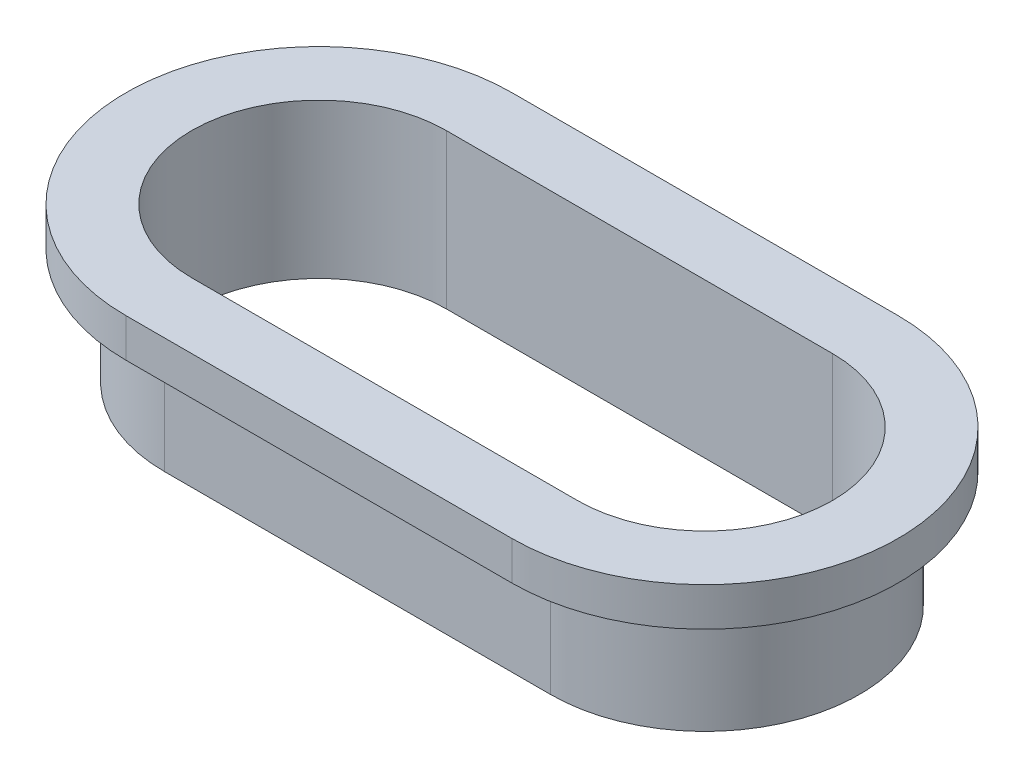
ISO-10303-21;
HEADER;
FILE_DESCRIPTION(('STEP AP214'),'2;1');
FILE_NAME('part.step','',(''),(''),'','','');
FILE_SCHEMA(('AUTOMOTIVE_DESIGN { 1 0 10303 214 1 1 1 1 }'));
ENDSEC;
DATA;
#1=APPLICATION_CONTEXT('core data for automotive mechanical design processes');
#2=APPLICATION_PROTOCOL_DEFINITION('international standard','automotive_design',2000,#1);
#3=PRODUCT_CONTEXT('',#1,'mechanical');
#4=PRODUCT('Part','Part','',(#3));
#5=PRODUCT_RELATED_PRODUCT_CATEGORY('part','',(#4));
#6=PRODUCT_DEFINITION_FORMATION('','',#4);
#7=PRODUCT_DEFINITION_CONTEXT('part definition',#1,'design');
#8=PRODUCT_DEFINITION('design','',#6,#7);
#9=PRODUCT_DEFINITION_SHAPE('','',#8);
#10=(LENGTH_UNIT() NAMED_UNIT(*) SI_UNIT(.MILLI.,.METRE.));
#11=(NAMED_UNIT(*) PLANE_ANGLE_UNIT() SI_UNIT($,.RADIAN.));
#12=(NAMED_UNIT(*) SI_UNIT($,.STERADIAN.) SOLID_ANGLE_UNIT());
#13=UNCERTAINTY_MEASURE_WITH_UNIT(LENGTH_MEASURE(1.E-05),#10,'distance_accuracy_value','');
#14=(GEOMETRIC_REPRESENTATION_CONTEXT(3) GLOBAL_UNCERTAINTY_ASSIGNED_CONTEXT((#13)) GLOBAL_UNIT_ASSIGNED_CONTEXT((#10,
#11,#12)) REPRESENTATION_CONTEXT('',''));
#15=CARTESIAN_POINT('',(0.,0.,0.));
#16=DIRECTION('',(0.,0.,1.));
#17=DIRECTION('',(1.,0.,0.));
#18=AXIS2_PLACEMENT_3D('',#15,#16,#17);
#19=CARTESIAN_POINT('',(2.5,2.,0.));
#20=DIRECTION('',(0.,-1.,0.));
#21=DIRECTION('',(0.,0.,-1.));
#22=AXIS2_PLACEMENT_3D('',#19,#20,#21);
#23=CYLINDRICAL_SURFACE('',#22,2.);
#24=DIRECTION('',(0.,1.,0.));
#25=VECTOR('',#24,1.);
#26=CARTESIAN_POINT('',(2.5,2.,2.));
#27=LINE('',#26,#25);
#28=CARTESIAN_POINT('',(2.5,1.5,2.));
#29=VERTEX_POINT('',#28);
#30=CARTESIAN_POINT('',(2.5,0.,2.));
#31=VERTEX_POINT('',#30);
#32=EDGE_CURVE('E104',#29,#31,#27,.F.);
#33=ORIENTED_EDGE('',*,*,#32,.T.);
#34=CARTESIAN_POINT('',(2.5,0.,0.));
#35=DIRECTION('',(0.,-1.,0.));
#36=DIRECTION('',(0.,0.,-1.));
#37=AXIS2_PLACEMENT_3D('',#34,#35,#36);
#38=CIRCLE('',#37,2.);
#39=CARTESIAN_POINT('',(2.5,0.,-2.));
#40=VERTEX_POINT('',#39);
#41=EDGE_CURVE('E20',#31,#40,#38,.F.);
#42=ORIENTED_EDGE('',*,*,#41,.T.);
#43=DIRECTION('',(0.,1.,0.));
#44=VECTOR('',#43,1.);
#45=CARTESIAN_POINT('',(2.5,2.,-2.));
#46=LINE('',#45,#44);
#47=CARTESIAN_POINT('',(2.5,1.5,-2.));
#48=VERTEX_POINT('',#47);
#49=EDGE_CURVE('E108',#40,#48,#46,.T.);
#50=ORIENTED_EDGE('',*,*,#49,.T.);
#51=CARTESIAN_POINT('',(2.5,1.5,0.));
#52=DIRECTION('',(0.,-1.,0.));
#53=DIRECTION('',(0.,0.,-1.));
#54=AXIS2_PLACEMENT_3D('',#51,#52,#53);
#55=CIRCLE('',#54,2.);
#56=EDGE_CURVE('E171',#48,#29,#55,.T.);
#57=ORIENTED_EDGE('',*,*,#56,.T.);
#58=EDGE_LOOP('',(#33,#42,#50,#57));
#59=FACE_BOUND('',#58,.T.);
#60=ADVANCED_FACE('F17',(#59),#23,.T.);
#61=CARTESIAN_POINT('',(-4.5,2.,2.));
#62=DIRECTION('',(0.,0.,-1.));
#63=DIRECTION('',(-1.,0.,0.));
#64=AXIS2_PLACEMENT_3D('',#61,#62,#63);
#65=PLANE('',#64);
#66=ORIENTED_EDGE('',*,*,#32,.F.);
#67=DIRECTION('',(1.,0.,0.));
#68=VECTOR('',#67,1.);
#69=CARTESIAN_POINT('',(0.,1.5,2.));
#70=LINE('',#69,#68);
#71=CARTESIAN_POINT('',(-2.5,1.5,2.));
#72=VERTEX_POINT('',#71);
#73=EDGE_CURVE('E170',#29,#72,#70,.F.);
#74=ORIENTED_EDGE('',*,*,#73,.T.);
#75=DIRECTION('',(0.,-1.,0.));
#76=VECTOR('',#75,1.);
#77=CARTESIAN_POINT('',(-2.5,2.,2.));
#78=LINE('',#77,#76);
#79=CARTESIAN_POINT('',(-2.5,0.,2.));
#80=VERTEX_POINT('',#79);
#81=EDGE_CURVE('E123',#80,#72,#78,.F.);
#82=ORIENTED_EDGE('',*,*,#81,.F.);
#83=DIRECTION('',(1.,0.,0.));
#84=VECTOR('',#83,1.);
#85=CARTESIAN_POINT('',(0.,0.,2.));
#86=LINE('',#85,#84);
#87=EDGE_CURVE('E129',#80,#31,#86,.T.);
#88=ORIENTED_EDGE('',*,*,#87,.T.);
#89=EDGE_LOOP('',(#66,#74,#82,#88));
#90=FACE_BOUND('',#89,.T.);
#91=ADVANCED_FACE('F174',(#90),#65,.F.);
#92=CARTESIAN_POINT('',(-2.5,2.,0.));
#93=DIRECTION('',(0.,-1.,0.));
#94=DIRECTION('',(0.,0.,-1.));
#95=AXIS2_PLACEMENT_3D('',#92,#93,#94);
#96=CYLINDRICAL_SURFACE('',#95,2.);
#97=DIRECTION('',(0.,1.,0.));
#98=VECTOR('',#97,1.);
#99=CARTESIAN_POINT('',(-2.5,2.,-2.));
#100=LINE('',#99,#98);
#101=CARTESIAN_POINT('',(-2.5,1.5,-2.));
#102=VERTEX_POINT('',#101);
#103=CARTESIAN_POINT('',(-2.5,0.,-2.));
#104=VERTEX_POINT('',#103);
#105=EDGE_CURVE('E114',#102,#104,#100,.F.);
#106=ORIENTED_EDGE('',*,*,#105,.T.);
#107=CARTESIAN_POINT('',(-2.5,0.,0.));
#108=DIRECTION('',(0.,-1.,0.));
#109=DIRECTION('',(0.,0.,-1.));
#110=AXIS2_PLACEMENT_3D('',#107,#108,#109);
#111=CIRCLE('',#110,2.);
#112=EDGE_CURVE('E127',#104,#80,#111,.F.);
#113=ORIENTED_EDGE('',*,*,#112,.T.);
#114=ORIENTED_EDGE('',*,*,#81,.T.);
#115=CARTESIAN_POINT('',(-2.5,1.5,0.));
#116=DIRECTION('',(0.,-1.,0.));
#117=DIRECTION('',(0.,0.,-1.));
#118=AXIS2_PLACEMENT_3D('',#115,#116,#117);
#119=CIRCLE('',#118,2.);
#120=EDGE_CURVE('E168',#72,#102,#119,.T.);
#121=ORIENTED_EDGE('',*,*,#120,.T.);
#122=EDGE_LOOP('',(#106,#113,#114,#121));
#123=FACE_BOUND('',#122,.T.);
#124=ADVANCED_FACE('F178',(#123),#96,.T.);
#125=CARTESIAN_POINT('',(-4.5,2.,-2.));
#126=DIRECTION('',(0.,0.,1.));
#127=DIRECTION('',(1.,0.,0.));
#128=AXIS2_PLACEMENT_3D('',#125,#126,#127);
#129=PLANE('',#128);
#130=ORIENTED_EDGE('',*,*,#105,.F.);
#131=DIRECTION('',(1.,0.,0.));
#132=VECTOR('',#131,1.);
#133=CARTESIAN_POINT('',(0.,1.5,-2.));
#134=LINE('',#133,#132);
#135=EDGE_CURVE('E121',#102,#48,#134,.T.);
#136=ORIENTED_EDGE('',*,*,#135,.T.);
#137=ORIENTED_EDGE('',*,*,#49,.F.);
#138=DIRECTION('',(1.,0.,0.));
#139=VECTOR('',#138,1.);
#140=CARTESIAN_POINT('',(0.,0.,-2.));
#141=LINE('',#140,#139);
#142=EDGE_CURVE('E113',#40,#104,#141,.F.);
#143=ORIENTED_EDGE('',*,*,#142,.T.);
#144=EDGE_LOOP('',(#130,#136,#137,#143));
#145=FACE_BOUND('',#144,.T.);
#146=ADVANCED_FACE('F118',(#145),#129,.F.);
#147=CARTESIAN_POINT('',(0.,0.,0.));
#148=DIRECTION('',(0.,1.,0.));
#149=DIRECTION('',(0.,0.,1.));
#150=AXIS2_PLACEMENT_3D('',#147,#148,#149);
#151=PLANE('',#150);
#152=CARTESIAN_POINT('',(2.5,0.,0.));
#153=DIRECTION('',(0.,1.,0.));
#154=DIRECTION('',(0.,0.,1.));
#155=AXIS2_PLACEMENT_3D('',#152,#153,#154);
#156=CIRCLE('',#155,1.65);
#157=CARTESIAN_POINT('',(2.5,0.,1.65));
#158=VERTEX_POINT('',#157);
#159=CARTESIAN_POINT('',(2.5,0.,-1.65));
#160=VERTEX_POINT('',#159);
#161=EDGE_CURVE('E164',#158,#160,#156,.T.);
#162=ORIENTED_EDGE('',*,*,#161,.T.);
#163=DIRECTION('',(1.,0.,0.));
#164=VECTOR('',#163,1.);
#165=CARTESIAN_POINT('',(-4.15,0.,-1.65));
#166=LINE('',#165,#164);
#167=CARTESIAN_POINT('',(-2.5,0.,-1.65));
#168=VERTEX_POINT('',#167);
#169=EDGE_CURVE('E133',#168,#160,#166,.T.);
#170=ORIENTED_EDGE('',*,*,#169,.F.);
#171=CARTESIAN_POINT('',(-2.5,0.,0.));
#172=DIRECTION('',(0.,1.,0.));
#173=DIRECTION('',(0.,0.,1.));
#174=AXIS2_PLACEMENT_3D('',#171,#172,#173);
#175=CIRCLE('',#174,1.65);
#176=CARTESIAN_POINT('',(-2.5,0.,1.65));
#177=VERTEX_POINT('',#176);
#178=EDGE_CURVE('E137',#168,#177,#175,.T.);
#179=ORIENTED_EDGE('',*,*,#178,.T.);
#180=DIRECTION('',(-1.,0.,0.));
#181=VECTOR('',#180,1.);
#182=CARTESIAN_POINT('',(-4.15,0.,1.65));
#183=LINE('',#182,#181);
#184=EDGE_CURVE('E186',#158,#177,#183,.T.);
#185=ORIENTED_EDGE('',*,*,#184,.F.);
#186=EDGE_LOOP('',(#162,#170,#179,#185));
#187=FACE_BOUND('',#186,.T.);
#188=ORIENTED_EDGE('',*,*,#112,.F.);
#189=ORIENTED_EDGE('',*,*,#142,.F.);
#190=ORIENTED_EDGE('',*,*,#41,.F.);
#191=ORIENTED_EDGE('',*,*,#87,.F.);
#192=EDGE_LOOP('',(#188,#189,#190,#191));
#193=FACE_BOUND('',#192,.T.);
#194=ADVANCED_FACE('F125',(#187,#193),#151,.F.);
#195=CARTESIAN_POINT('',(0.,1.5,0.));
#196=DIRECTION('',(0.,1.,0.));
#197=DIRECTION('',(0.,0.,1.));
#198=AXIS2_PLACEMENT_3D('',#195,#196,#197);
#199=PLANE('',#198);
#200=CARTESIAN_POINT('',(2.5,1.5,0.));
#201=DIRECTION('',(0.,1.,0.));
#202=DIRECTION('',(0.,0.,1.));
#203=AXIS2_PLACEMENT_3D('',#200,#201,#202);
#204=CIRCLE('',#203,2.5);
#205=CARTESIAN_POINT('',(2.5,1.5,2.5));
#206=VERTEX_POINT('',#205);
#207=CARTESIAN_POINT('',(2.5,1.5,-2.5));
#208=VERTEX_POINT('',#207);
#209=EDGE_CURVE('E156',#206,#208,#204,.T.);
#210=ORIENTED_EDGE('',*,*,#209,.F.);
#211=DIRECTION('',(1.,0.,0.));
#212=VECTOR('',#211,1.);
#213=CARTESIAN_POINT('',(-5.,1.5,2.5));
#214=LINE('',#213,#212);
#215=CARTESIAN_POINT('',(-2.5,1.5,2.5));
#216=VERTEX_POINT('',#215);
#217=EDGE_CURVE('E185',#216,#206,#214,.T.);
#218=ORIENTED_EDGE('',*,*,#217,.F.);
#219=CARTESIAN_POINT('',(-2.5,1.5,0.));
#220=DIRECTION('',(0.,1.,0.));
#221=DIRECTION('',(0.,0.,1.));
#222=AXIS2_PLACEMENT_3D('',#219,#220,#221);
#223=CIRCLE('',#222,2.5);
#224=CARTESIAN_POINT('',(-2.5,1.5,-2.5));
#225=VERTEX_POINT('',#224);
#226=EDGE_CURVE('E160',#225,#216,#223,.T.);
#227=ORIENTED_EDGE('',*,*,#226,.F.);
#228=DIRECTION('',(-1.,0.,0.));
#229=VECTOR('',#228,1.);
#230=CARTESIAN_POINT('',(-5.,1.5,-2.5));
#231=LINE('',#230,#229);
#232=EDGE_CURVE('E158',#208,#225,#231,.T.);
#233=ORIENTED_EDGE('',*,*,#232,.F.);
#234=EDGE_LOOP('',(#210,#218,#227,#233));
#235=FACE_BOUND('',#234,.T.);
#236=ORIENTED_EDGE('',*,*,#120,.F.);
#237=ORIENTED_EDGE('',*,*,#73,.F.);
#238=ORIENTED_EDGE('',*,*,#56,.F.);
#239=ORIENTED_EDGE('',*,*,#135,.F.);
#240=EDGE_LOOP('',(#236,#237,#238,#239));
#241=FACE_BOUND('',#240,.T.);
#242=ADVANCED_FACE('F180',(#235,#241),#199,.F.);
#243=CARTESIAN_POINT('',(-2.5,2.,0.));
#244=DIRECTION('',(0.,1.,0.));
#245=DIRECTION('',(0.,0.,1.));
#246=AXIS2_PLACEMENT_3D('',#243,#244,#245);
#247=CYLINDRICAL_SURFACE('',#246,1.65);
#248=DIRECTION('',(0.,1.,0.));
#249=VECTOR('',#248,1.);
#250=CARTESIAN_POINT('',(-2.5,2.,1.65));
#251=LINE('',#250,#249);
#252=CARTESIAN_POINT('',(-2.5,2.,1.65));
#253=VERTEX_POINT('',#252);
#254=EDGE_CURVE('E163',#177,#253,#251,.T.);
#255=ORIENTED_EDGE('',*,*,#254,.F.);
#256=ORIENTED_EDGE('',*,*,#178,.F.);
#257=DIRECTION('',(0.,1.,0.));
#258=VECTOR('',#257,1.);
#259=CARTESIAN_POINT('',(-2.5,2.,-1.65));
#260=LINE('',#259,#258);
#261=CARTESIAN_POINT('',(-2.5,2.,-1.65));
#262=VERTEX_POINT('',#261);
#263=EDGE_CURVE('E136',#262,#168,#260,.F.);
#264=ORIENTED_EDGE('',*,*,#263,.F.);
#265=CARTESIAN_POINT('',(-2.5,2.,0.));
#266=DIRECTION('',(0.,1.,0.));
#267=DIRECTION('',(0.,0.,1.));
#268=AXIS2_PLACEMENT_3D('',#265,#266,#267);
#269=CIRCLE('',#268,1.65);
#270=EDGE_CURVE('E153',#253,#262,#269,.F.);
#271=ORIENTED_EDGE('',*,*,#270,.F.);
#272=EDGE_LOOP('',(#255,#256,#264,#271));
#273=FACE_BOUND('',#272,.T.);
#274=ADVANCED_FACE('F208',(#273),#247,.F.);
#275=CARTESIAN_POINT('',(-4.15,2.,-1.65));
#276=DIRECTION('',(0.,0.,1.));
#277=DIRECTION('',(1.,0.,0.));
#278=AXIS2_PLACEMENT_3D('',#275,#276,#277);
#279=PLANE('',#278);
#280=DIRECTION('',(1.,0.,0.));
#281=VECTOR('',#280,1.);
#282=CARTESIAN_POINT('',(0.,2.,-1.65));
#283=LINE('',#282,#281);
#284=CARTESIAN_POINT('',(2.5,2.,-1.65));
#285=VERTEX_POINT('',#284);
#286=EDGE_CURVE('E152',#262,#285,#283,.T.);
#287=ORIENTED_EDGE('',*,*,#286,.F.);
#288=ORIENTED_EDGE('',*,*,#263,.T.);
#289=ORIENTED_EDGE('',*,*,#169,.T.);
#290=DIRECTION('',(0.,1.,0.));
#291=VECTOR('',#290,1.);
#292=CARTESIAN_POINT('',(2.5,2.,-1.65));
#293=LINE('',#292,#291);
#294=EDGE_CURVE('E166',#160,#285,#293,.T.);
#295=ORIENTED_EDGE('',*,*,#294,.T.);
#296=EDGE_LOOP('',(#287,#288,#289,#295));
#297=FACE_BOUND('',#296,.T.);
#298=ADVANCED_FACE('F202',(#297),#279,.T.);
#299=CARTESIAN_POINT('',(2.5,2.,0.));
#300=DIRECTION('',(0.,1.,0.));
#301=DIRECTION('',(0.,0.,1.));
#302=AXIS2_PLACEMENT_3D('',#299,#300,#301);
#303=CYLINDRICAL_SURFACE('',#302,1.65);
#304=ORIENTED_EDGE('',*,*,#294,.F.);
#305=ORIENTED_EDGE('',*,*,#161,.F.);
#306=DIRECTION('',(0.,1.,0.));
#307=VECTOR('',#306,1.);
#308=CARTESIAN_POINT('',(2.5,2.,1.65));
#309=LINE('',#308,#307);
#310=CARTESIAN_POINT('',(2.5,2.,1.65));
#311=VERTEX_POINT('',#310);
#312=EDGE_CURVE('E188',#311,#158,#309,.F.);
#313=ORIENTED_EDGE('',*,*,#312,.F.);
#314=CARTESIAN_POINT('',(2.5,2.,0.));
#315=DIRECTION('',(0.,1.,0.));
#316=DIRECTION('',(0.,0.,1.));
#317=AXIS2_PLACEMENT_3D('',#314,#315,#316);
#318=CIRCLE('',#317,1.65);
#319=EDGE_CURVE('E149',#285,#311,#318,.F.);
#320=ORIENTED_EDGE('',*,*,#319,.F.);
#321=EDGE_LOOP('',(#304,#305,#313,#320));
#322=FACE_BOUND('',#321,.T.);
#323=ADVANCED_FACE('F211',(#322),#303,.F.);
#324=CARTESIAN_POINT('',(-4.15,2.,1.65));
#325=DIRECTION('',(0.,0.,-1.));
#326=DIRECTION('',(-1.,0.,0.));
#327=AXIS2_PLACEMENT_3D('',#324,#325,#326);
#328=PLANE('',#327);
#329=ORIENTED_EDGE('',*,*,#184,.T.);
#330=ORIENTED_EDGE('',*,*,#254,.T.);
#331=DIRECTION('',(1.,0.,0.));
#332=VECTOR('',#331,1.);
#333=CARTESIAN_POINT('',(0.,2.,1.65));
#334=LINE('',#333,#332);
#335=EDGE_CURVE('E148',#311,#253,#334,.F.);
#336=ORIENTED_EDGE('',*,*,#335,.F.);
#337=ORIENTED_EDGE('',*,*,#312,.T.);
#338=EDGE_LOOP('',(#329,#330,#336,#337));
#339=FACE_BOUND('',#338,.T.);
#340=ADVANCED_FACE('F241',(#339),#328,.T.);
#341=CARTESIAN_POINT('',(-2.5,1.5,0.));
#342=DIRECTION('',(0.,1.,0.));
#343=DIRECTION('',(0.,0.,1.));
#344=AXIS2_PLACEMENT_3D('',#341,#342,#343);
#345=CYLINDRICAL_SURFACE('',#344,2.5);
#346=DIRECTION('',(0.,1.,0.));
#347=VECTOR('',#346,1.);
#348=CARTESIAN_POINT('',(-2.5,1.5,2.5));
#349=LINE('',#348,#347);
#350=CARTESIAN_POINT('',(-2.5,2.,2.5));
#351=VERTEX_POINT('',#350);
#352=EDGE_CURVE('E162',#351,#216,#349,.F.);
#353=ORIENTED_EDGE('',*,*,#352,.F.);
#354=CARTESIAN_POINT('',(-2.5,2.,0.));
#355=DIRECTION('',(0.,1.,0.));
#356=DIRECTION('',(0.,0.,1.));
#357=AXIS2_PLACEMENT_3D('',#354,#355,#356);
#358=CIRCLE('',#357,2.5);
#359=CARTESIAN_POINT('',(-2.5,2.,-2.5));
#360=VERTEX_POINT('',#359);
#361=EDGE_CURVE('E145',#360,#351,#358,.T.);
#362=ORIENTED_EDGE('',*,*,#361,.F.);
#363=DIRECTION('',(0.,1.,0.));
#364=VECTOR('',#363,1.);
#365=CARTESIAN_POINT('',(-2.5,1.5,-2.5));
#366=LINE('',#365,#364);
#367=EDGE_CURVE('E221',#225,#360,#366,.T.);
#368=ORIENTED_EDGE('',*,*,#367,.F.);
#369=ORIENTED_EDGE('',*,*,#226,.T.);
#370=EDGE_LOOP('',(#353,#362,#368,#369));
#371=FACE_BOUND('',#370,.T.);
#372=ADVANCED_FACE('F239',(#371),#345,.T.);
#373=CARTESIAN_POINT('',(-5.,1.5,2.5));
#374=DIRECTION('',(0.,0.,1.));
#375=DIRECTION('',(1.,0.,0.));
#376=AXIS2_PLACEMENT_3D('',#373,#374,#375);
#377=PLANE('',#376);
#378=ORIENTED_EDGE('',*,*,#217,.T.);
#379=DIRECTION('',(0.,1.,0.));
#380=VECTOR('',#379,1.);
#381=CARTESIAN_POINT('',(2.5,1.5,2.5));
#382=LINE('',#381,#380);
#383=CARTESIAN_POINT('',(2.5,2.,2.5));
#384=VERTEX_POINT('',#383);
#385=EDGE_CURVE('E159',#384,#206,#382,.F.);
#386=ORIENTED_EDGE('',*,*,#385,.F.);
#387=DIRECTION('',(1.,0.,0.));
#388=VECTOR('',#387,1.);
#389=CARTESIAN_POINT('',(0.,2.,2.5));
#390=LINE('',#389,#388);
#391=EDGE_CURVE('E144',#351,#384,#390,.T.);
#392=ORIENTED_EDGE('',*,*,#391,.F.);
#393=ORIENTED_EDGE('',*,*,#352,.T.);
#394=EDGE_LOOP('',(#378,#386,#392,#393));
#395=FACE_BOUND('',#394,.T.);
#396=ADVANCED_FACE('F229',(#395),#377,.T.);
#397=CARTESIAN_POINT('',(2.5,1.5,0.));
#398=DIRECTION('',(0.,1.,0.));
#399=DIRECTION('',(0.,0.,1.));
#400=AXIS2_PLACEMENT_3D('',#397,#398,#399);
#401=CYLINDRICAL_SURFACE('',#400,2.5);
#402=DIRECTION('',(0.,1.,0.));
#403=VECTOR('',#402,1.);
#404=CARTESIAN_POINT('',(2.5,1.5,-2.5));
#405=LINE('',#404,#403);
#406=CARTESIAN_POINT('',(2.5,2.,-2.5));
#407=VERTEX_POINT('',#406);
#408=EDGE_CURVE('E35',#407,#208,#405,.F.);
#409=ORIENTED_EDGE('',*,*,#408,.F.);
#410=CARTESIAN_POINT('',(2.5,2.,0.));
#411=DIRECTION('',(0.,1.,0.));
#412=DIRECTION('',(0.,0.,1.));
#413=AXIS2_PLACEMENT_3D('',#410,#411,#412);
#414=CIRCLE('',#413,2.5);
#415=EDGE_CURVE('E26',#384,#407,#414,.T.);
#416=ORIENTED_EDGE('',*,*,#415,.F.);
#417=ORIENTED_EDGE('',*,*,#385,.T.);
#418=ORIENTED_EDGE('',*,*,#209,.T.);
#419=EDGE_LOOP('',(#409,#416,#417,#418));
#420=FACE_BOUND('',#419,.T.);
#421=ADVANCED_FACE('F224',(#420),#401,.T.);
#422=CARTESIAN_POINT('',(-5.,1.5,-2.5));
#423=DIRECTION('',(0.,0.,-1.));
#424=DIRECTION('',(-1.,0.,0.));
#425=AXIS2_PLACEMENT_3D('',#422,#423,#424);
#426=PLANE('',#425);
#427=DIRECTION('',(1.,0.,0.));
#428=VECTOR('',#427,1.);
#429=CARTESIAN_POINT('',(0.,2.,-2.5));
#430=LINE('',#429,#428);
#431=EDGE_CURVE('E11',#407,#360,#430,.F.);
#432=ORIENTED_EDGE('',*,*,#431,.F.);
#433=ORIENTED_EDGE('',*,*,#408,.T.);
#434=ORIENTED_EDGE('',*,*,#232,.T.);
#435=ORIENTED_EDGE('',*,*,#367,.T.);
#436=EDGE_LOOP('',(#432,#433,#434,#435));
#437=FACE_BOUND('',#436,.T.);
#438=ADVANCED_FACE('F236',(#437),#426,.T.);
#439=CARTESIAN_POINT('',(0.,2.,0.));
#440=DIRECTION('',(0.,1.,0.));
#441=DIRECTION('',(0.,0.,1.));
#442=AXIS2_PLACEMENT_3D('',#439,#440,#441);
#443=PLANE('',#442);
#444=ORIENTED_EDGE('',*,*,#415,.T.);
#445=ORIENTED_EDGE('',*,*,#431,.T.);
#446=ORIENTED_EDGE('',*,*,#361,.T.);
#447=ORIENTED_EDGE('',*,*,#391,.T.);
#448=EDGE_LOOP('',(#444,#445,#446,#447));
#449=FACE_BOUND('',#448,.T.);
#450=ORIENTED_EDGE('',*,*,#319,.T.);
#451=ORIENTED_EDGE('',*,*,#335,.T.);
#452=ORIENTED_EDGE('',*,*,#270,.T.);
#453=ORIENTED_EDGE('',*,*,#286,.T.);
#454=EDGE_LOOP('',(#450,#451,#452,#453));
#455=FACE_BOUND('',#454,.T.);
#456=ADVANCED_FACE('F215',(#449,#455),#443,.T.);
#457=CLOSED_SHELL('',(#60,#91,#124,#146,#194,#242,#274,#298,#323,#340,#372,#396,#421,#438,#456));
#458=MANIFOLD_SOLID_BREP('B1',#457);
#459=ADVANCED_BREP_SHAPE_REPRESENTATION('',(#18,#458),#14);
#460=SHAPE_DEFINITION_REPRESENTATION(#9,#459);
ENDSEC;
END-ISO-10303-21;
